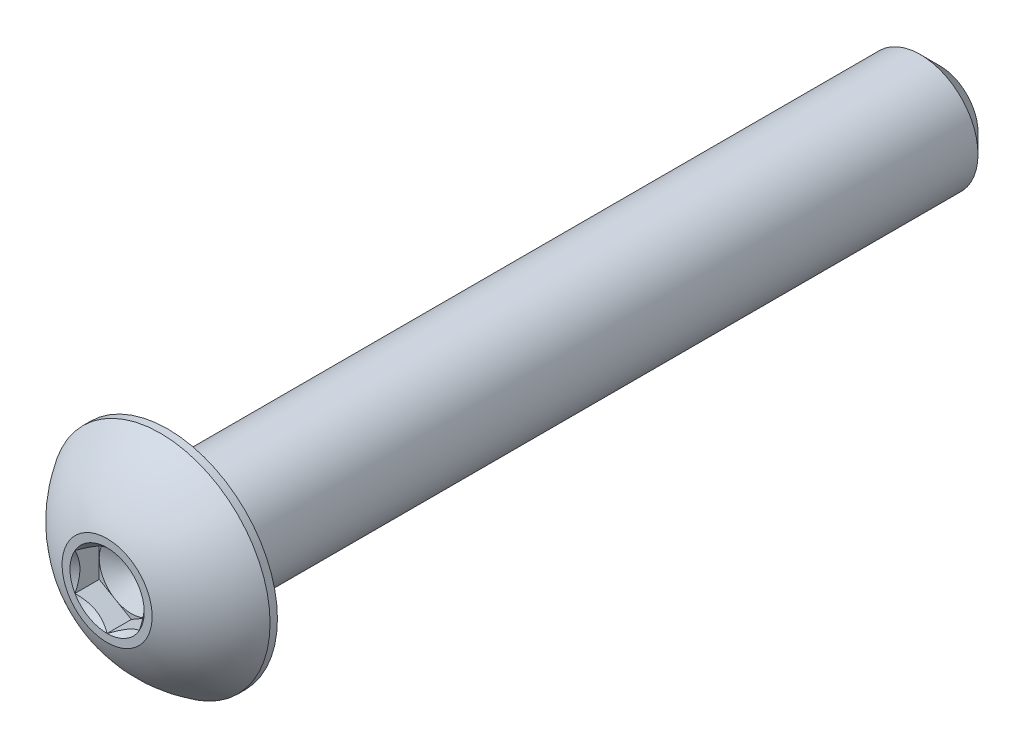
ISO-10303-21;
HEADER;
FILE_DESCRIPTION(('STEP AP214'),'2;1');
FILE_NAME('part.step','',(''),(''),'','','');
FILE_SCHEMA(('AUTOMOTIVE_DESIGN { 1 0 10303 214 1 1 1 1 }'));
ENDSEC;
DATA;
#1=APPLICATION_CONTEXT('core data for automotive mechanical design processes');
#2=APPLICATION_PROTOCOL_DEFINITION('international standard','automotive_design',2000,#1);
#3=PRODUCT_CONTEXT('',#1,'mechanical');
#4=PRODUCT('Part','Part','',(#3));
#5=PRODUCT_RELATED_PRODUCT_CATEGORY('part','',(#4));
#6=PRODUCT_DEFINITION_FORMATION('','',#4);
#7=PRODUCT_DEFINITION_CONTEXT('part definition',#1,'design');
#8=PRODUCT_DEFINITION('design','',#6,#7);
#9=PRODUCT_DEFINITION_SHAPE('','',#8);
#10=(LENGTH_UNIT() NAMED_UNIT(*) SI_UNIT(.MILLI.,.METRE.));
#11=(NAMED_UNIT(*) PLANE_ANGLE_UNIT() SI_UNIT($,.RADIAN.));
#12=(NAMED_UNIT(*) SI_UNIT($,.STERADIAN.) SOLID_ANGLE_UNIT());
#13=UNCERTAINTY_MEASURE_WITH_UNIT(LENGTH_MEASURE(1.E-05),#10,'distance_accuracy_value','');
#14=(GEOMETRIC_REPRESENTATION_CONTEXT(3) GLOBAL_UNCERTAINTY_ASSIGNED_CONTEXT((#13)) GLOBAL_UNIT_ASSIGNED_CONTEXT((#10,
#11,#12)) REPRESENTATION_CONTEXT('',''));
#15=CARTESIAN_POINT('',(0.,0.,0.));
#16=DIRECTION('',(0.,0.,1.));
#17=DIRECTION('',(1.,0.,0.));
#18=AXIS2_PLACEMENT_3D('',#15,#16,#17);
#19=CARTESIAN_POINT('',(0.,0.79375,10.2743));
#20=DIRECTION('',(0.,0.,-1.));
#21=DIRECTION('',(-1.,0.,0.));
#22=AXIS2_PLACEMENT_3D('',#19,#20,#21);
#23=PLANE('',#22);
#24=CARTESIAN_POINT('',(0.,0.,10.2743));
#25=DIRECTION('',(0.,0.,1.));
#26=DIRECTION('',(1.,0.,0.));
#27=AXIS2_PLACEMENT_3D('',#24,#25,#26);
#28=CIRCLE('',#27,1.11125);
#29=CARTESIAN_POINT('',(0.,1.11125,10.2743));
#30=VERTEX_POINT('',#29);
#31=EDGE_CURVE('E167',#30,#30,#28,.T.);
#32=ORIENTED_EDGE('',*,*,#31,.T.);
#33=EDGE_LOOP('',(#32));
#34=FACE_BOUND('',#33,.T.);
#35=CARTESIAN_POINT('',(0.,0.,10.2743));
#36=DIRECTION('',(0.,0.,1.));
#37=DIRECTION('',(1.,0.,0.));
#38=AXIS2_PLACEMENT_3D('',#35,#36,#37);
#39=CIRCLE('',#38,0.916543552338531);
#40=CARTESIAN_POINT('',(0.,0.916543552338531,10.2743));
#41=VERTEX_POINT('',#40);
#42=CARTESIAN_POINT('',(-0.79375,0.458271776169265,10.2743));
#43=VERTEX_POINT('',#42);
#44=EDGE_CURVE('E121',#41,#43,#39,.T.);
#45=ORIENTED_EDGE('',*,*,#44,.F.);
#46=CARTESIAN_POINT('',(0.,0.,10.2743));
#47=DIRECTION('',(0.,0.,1.));
#48=DIRECTION('',(1.,0.,0.));
#49=AXIS2_PLACEMENT_3D('',#46,#47,#48);
#50=CIRCLE('',#49,0.916543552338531);
#51=CARTESIAN_POINT('',(0.79375,0.458271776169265,10.2743));
#52=VERTEX_POINT('',#51);
#53=EDGE_CURVE('E106',#52,#41,#50,.T.);
#54=ORIENTED_EDGE('',*,*,#53,.F.);
#55=CARTESIAN_POINT('',(0.,0.,10.2743));
#56=DIRECTION('',(0.,0.,1.));
#57=DIRECTION('',(1.,0.,0.));
#58=AXIS2_PLACEMENT_3D('',#55,#56,#57);
#59=CIRCLE('',#58,0.916543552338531);
#60=CARTESIAN_POINT('',(0.79375,-0.458271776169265,10.2743));
#61=VERTEX_POINT('',#60);
#62=EDGE_CURVE('E117',#61,#52,#59,.T.);
#63=ORIENTED_EDGE('',*,*,#62,.F.);
#64=CARTESIAN_POINT('',(0.,0.,10.2743));
#65=DIRECTION('',(0.,0.,1.));
#66=DIRECTION('',(1.,0.,0.));
#67=AXIS2_PLACEMENT_3D('',#64,#65,#66);
#68=CIRCLE('',#67,0.916543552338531);
#69=CARTESIAN_POINT('',(0.,-0.916543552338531,10.2743));
#70=VERTEX_POINT('',#69);
#71=EDGE_CURVE('E138',#70,#61,#68,.T.);
#72=ORIENTED_EDGE('',*,*,#71,.F.);
#73=CARTESIAN_POINT('',(0.,0.,10.2743));
#74=DIRECTION('',(0.,0.,1.));
#75=DIRECTION('',(1.,0.,0.));
#76=AXIS2_PLACEMENT_3D('',#73,#74,#75);
#77=CIRCLE('',#76,0.916543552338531);
#78=CARTESIAN_POINT('',(-0.79375,-0.458271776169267,10.2743));
#79=VERTEX_POINT('',#78);
#80=EDGE_CURVE('E438',#79,#70,#77,.T.);
#81=ORIENTED_EDGE('',*,*,#80,.F.);
#82=CARTESIAN_POINT('',(0.,0.,10.2743));
#83=DIRECTION('',(0.,0.,1.));
#84=DIRECTION('',(1.,0.,0.));
#85=AXIS2_PLACEMENT_3D('',#82,#83,#84);
#86=CIRCLE('',#85,0.916543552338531);
#87=EDGE_CURVE('E447',#43,#79,#86,.T.);
#88=ORIENTED_EDGE('',*,*,#87,.F.);
#89=EDGE_LOOP('',(#45,#54,#63,#72,#81,#88));
#90=FACE_BOUND('',#89,.T.);
#91=ADVANCED_FACE('F33',(#34,#90),#23,.F.);
#92=CARTESIAN_POINT('',(0.,0.,-10.2743));
#93=DIRECTION('',(0.,0.,1.));
#94=DIRECTION('',(1.,0.,0.));
#95=AXIS2_PLACEMENT_3D('',#92,#93,#94);
#96=CONICAL_SURFACE('',#95,0.946150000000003,0.785398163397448);
#97=CARTESIAN_POINT('',(0.,0.,-9.79805));
#98=DIRECTION('',(0.,0.,1.));
#99=DIRECTION('',(1.,0.,0.));
#100=AXIS2_PLACEMENT_3D('',#97,#98,#99);
#101=CIRCLE('',#100,1.4224);
#102=CARTESIAN_POINT('',(1.4224,0.,-9.79805));
#103=VERTEX_POINT('',#102);
#104=EDGE_CURVE('E11',#103,#103,#101,.T.);
#105=ORIENTED_EDGE('',*,*,#104,.F.);
#106=EDGE_LOOP('',(#105));
#107=FACE_BOUND('',#106,.T.);
#108=CARTESIAN_POINT('',(0.,0.,-10.2743));
#109=DIRECTION('',(0.,0.,1.));
#110=DIRECTION('',(1.,0.,0.));
#111=AXIS2_PLACEMENT_3D('',#108,#109,#110);
#112=CIRCLE('',#111,0.946150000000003);
#113=CARTESIAN_POINT('',(0.946150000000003,0.,-10.2743));
#114=VERTEX_POINT('',#113);
#115=EDGE_CURVE('E160',#114,#114,#112,.T.);
#116=ORIENTED_EDGE('',*,*,#115,.T.);
#117=EDGE_LOOP('',(#116));
#118=FACE_BOUND('',#117,.T.);
#119=ADVANCED_FACE('F35',(#107,#118),#96,.T.);
#120=CARTESIAN_POINT('',(0.,0.,10.2743));
#121=DIRECTION('',(0.,0.,1.));
#122=DIRECTION('',(1.,0.,0.));
#123=AXIS2_PLACEMENT_3D('',#120,#121,#122);
#124=CYLINDRICAL_SURFACE('',#123,1.4224);
#125=CARTESIAN_POINT('',(0.,0.,8.7757));
#126=DIRECTION('',(0.,0.,1.));
#127=DIRECTION('',(1.,0.,0.));
#128=AXIS2_PLACEMENT_3D('',#125,#126,#127);
#129=CIRCLE('',#128,1.4224);
#130=CARTESIAN_POINT('',(1.4224,0.,8.7757));
#131=VERTEX_POINT('',#130);
#132=EDGE_CURVE('E41',#131,#131,#129,.T.);
#133=ORIENTED_EDGE('',*,*,#132,.F.);
#134=EDGE_LOOP('',(#133));
#135=FACE_BOUND('',#134,.T.);
#136=ORIENTED_EDGE('',*,*,#104,.T.);
#137=EDGE_LOOP('',(#136));
#138=FACE_BOUND('',#137,.T.);
#139=ADVANCED_FACE('F181',(#135,#138),#124,.T.);
#140=CARTESIAN_POINT('',(0.,2.7051,8.7757));
#141=DIRECTION('',(0.,0.,1.));
#142=DIRECTION('',(1.,0.,0.));
#143=AXIS2_PLACEMENT_3D('',#140,#141,#142);
#144=PLANE('',#143);
#145=CARTESIAN_POINT('',(0.,0.,8.7757));
#146=DIRECTION('',(0.,0.,1.));
#147=DIRECTION('',(1.,0.,0.));
#148=AXIS2_PLACEMENT_3D('',#145,#146,#147);
#149=CIRCLE('',#148,2.7051);
#150=CARTESIAN_POINT('',(2.7051,0.,8.7757));
#151=VERTEX_POINT('',#150);
#152=EDGE_CURVE('E174',#151,#151,#149,.T.);
#153=ORIENTED_EDGE('',*,*,#152,.F.);
#154=EDGE_LOOP('',(#153));
#155=FACE_BOUND('',#154,.T.);
#156=ORIENTED_EDGE('',*,*,#132,.T.);
#157=EDGE_LOOP('',(#156));
#158=FACE_BOUND('',#157,.T.);
#159=ADVANCED_FACE('F179',(#155,#158),#144,.F.);
#160=CARTESIAN_POINT('',(0.,0.,10.2743));
#161=DIRECTION('',(0.,0.,1.));
#162=DIRECTION('',(1.,0.,0.));
#163=AXIS2_PLACEMENT_3D('',#160,#161,#162);
#164=CYLINDRICAL_SURFACE('',#163,2.7051);
#165=CARTESIAN_POINT('',(0.,0.,8.95712857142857));
#166=DIRECTION('',(0.,0.,1.));
#167=DIRECTION('',(1.,0.,0.));
#168=AXIS2_PLACEMENT_3D('',#165,#166,#167);
#169=CIRCLE('',#168,2.7051);
#170=CARTESIAN_POINT('',(0.,2.7051,8.95712857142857));
#171=VERTEX_POINT('',#170);
#172=EDGE_CURVE('E171',#171,#171,#169,.T.);
#173=ORIENTED_EDGE('',*,*,#172,.F.);
#174=EDGE_LOOP('',(#173));
#175=FACE_BOUND('',#174,.T.);
#176=ORIENTED_EDGE('',*,*,#152,.T.);
#177=EDGE_LOOP('',(#176));
#178=FACE_BOUND('',#177,.T.);
#179=ADVANCED_FACE('F200',(#175,#178),#164,.T.);
#180=CARTESIAN_POINT('',(0.,0.,7.30671740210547));
#181=DIRECTION('',(0.,0.,1.));
#182=DIRECTION('',(0.,1.,0.));
#183=AXIS2_PLACEMENT_3D('',#180,#181,#182);
#184=SPHERICAL_SURFACE('',#183,3.16882044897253);
#185=CARTESIAN_POINT('',(0.,1.11125,10.2743));
#186=CARTESIAN_POINT('',(0.,1.13179667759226,10.2666060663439));
#187=CARTESIAN_POINT('',(0.,1.15226342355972,10.2586986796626));
#188=CARTESIAN_POINT('',(0.,1.19302827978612,10.2424605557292));
#189=CARTESIAN_POINT('',(0.,1.21332639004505,10.2341298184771));
#190=CARTESIAN_POINT('',(0.,1.25374520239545,10.2170485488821));
#191=CARTESIAN_POINT('',(0.,1.27386590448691,10.2082980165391));
#192=CARTESIAN_POINT('',(0.,1.31392122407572,10.1903809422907));
#193=CARTESIAN_POINT('',(0.,1.33385584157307,10.1812144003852));
#194=CARTESIAN_POINT('',(0.,1.37353039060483,10.1624692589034));
#195=CARTESIAN_POINT('',(0.,1.39327032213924,10.1528906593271));
#196=CARTESIAN_POINT('',(0.,1.43254698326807,10.1333255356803));
#197=CARTESIAN_POINT('',(0.,1.45208371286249,10.1233390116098));
#198=CARTESIAN_POINT('',(0.,1.49094554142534,10.102962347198));
#199=CARTESIAN_POINT('',(0.,1.51027064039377,10.0925722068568));
#200=CARTESIAN_POINT('',(0.,1.54870087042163,10.071392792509));
#201=CARTESIAN_POINT('',(0.,1.56780600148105,10.0606035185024));
#202=CARTESIAN_POINT('',(0.,1.60578805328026,10.0386304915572));
#203=CARTESIAN_POINT('',(0.,1.62466497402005,10.0274467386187));
#204=CARTESIAN_POINT('',(0.,1.66218246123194,10.0046895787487));
#205=CARTESIAN_POINT('',(0.,1.68082302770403,9.99311617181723));
#206=CARTESIAN_POINT('',(0.,1.71785976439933,9.96958469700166));
#207=CARTESIAN_POINT('',(0.,1.73625593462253,9.95762662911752));
#208=CARTESIAN_POINT('',(0.,1.77279594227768,9.9333309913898));
#209=CARTESIAN_POINT('',(0.,1.79093977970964,9.92099342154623));
#210=CARTESIAN_POINT('',(0.,1.82696729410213,9.8959441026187));
#211=CARTESIAN_POINT('',(0.,1.84485097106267,9.88323235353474));
#212=CARTESIAN_POINT('',(0.,1.88035044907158,9.85744016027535));
#213=CARTESIAN_POINT('',(0.,1.89796625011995,9.84435971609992));
#214=CARTESIAN_POINT('',(0.,1.93292237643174,9.81783577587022));
#215=CARTESIAN_POINT('',(0.,1.95026270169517,9.80439227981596));
#216=CARTESIAN_POINT('',(0.,1.98466039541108,9.77714803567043));
#217=CARTESIAN_POINT('',(0.,2.00171776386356,9.76334728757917));
#218=CARTESIAN_POINT('',(0.,2.03554218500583,9.73539449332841));
#219=CARTESIAN_POINT('',(0.,2.05230923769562,9.72124244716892));
#220=CARTESIAN_POINT('',(0.,2.08554579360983,9.6925931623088));
#221=CARTESIAN_POINT('',(0.,2.10201529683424,9.67809592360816));
#222=CARTESIAN_POINT('',(0.,2.13464964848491,9.64876250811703));
#223=CARTESIAN_POINT('',(0.,2.15081449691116,9.63392633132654));
#224=CARTESIAN_POINT('',(0.,2.18283256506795,9.60392144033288));
#225=CARTESIAN_POINT('',(0.,2.19868578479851,9.58875272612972));
#226=CARTESIAN_POINT('',(0.,2.23007375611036,9.5580893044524));
#227=CARTESIAN_POINT('',(0.,2.24560850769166,9.54259459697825));
#228=CARTESIAN_POINT('',(0.,2.27635284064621,9.51128587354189));
#229=CARTESIAN_POINT('',(0.,2.29156242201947,9.49547185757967));
#230=CARTESIAN_POINT('',(0.,2.32164985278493,9.46353133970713));
#231=CARTESIAN_POINT('',(0.,2.33652770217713,9.4474048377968));
#232=CARTESIAN_POINT('',(0.,2.3659452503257,9.41484630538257));
#233=CARTESIAN_POINT('',(0.,2.38048494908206,9.39841427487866));
#234=CARTESIAN_POINT('',(0.,2.40921992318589,9.36525177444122));
#235=CARTESIAN_POINT('',(0.,2.42341519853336,9.3485213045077));
#236=CARTESIAN_POINT('',(0.,2.45145520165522,9.31476914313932));
#237=CARTESIAN_POINT('',(0.,2.4652999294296,9.29774745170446));
#238=CARTESIAN_POINT('',(0.,2.49263286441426,9.26342019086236));
#239=CARTESIAN_POINT('',(0.,2.50612107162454,9.24611462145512));
#240=CARTESIAN_POINT('',(0.,2.53273514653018,9.21122707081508));
#241=CARTESIAN_POINT('',(0.,2.54586101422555,9.19364508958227));
#242=CARTESIAN_POINT('',(0.,2.57174474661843,9.15821230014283));
#243=CARTESIAN_POINT('',(0.,2.58450261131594,9.1403614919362));
#244=CARTESIAN_POINT('',(0.,2.60964483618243,9.10439875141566));
#245=CARTESIAN_POINT('',(0.,2.62202919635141,9.08628681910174));
#246=CARTESIAN_POINT('',(0.,2.64641905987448,9.04980963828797));
#247=CARTESIAN_POINT('',(0.,2.65842456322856,9.03144438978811));
#248=CARTESIAN_POINT('',(0.,2.68205156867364,8.99446852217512));
#249=CARTESIAN_POINT('',(0.,2.69367307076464,8.97585790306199));
#250=CARTESIAN_POINT('',(0.,2.7051,8.95712857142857));
#251=B_SPLINE_CURVE_WITH_KNOTS('',3,(#185,#186,#187,#188,#189,#190,#191,#192,#193,#194,#195,
#196,#197,#198,#199,#200,#201,#202,#203,#204,#205,#206,#207,#208,#209,#210,#211,#212,#213,#214,
#215,#216,#217,#218,#219,#220,#221,#222,#223,#224,#225,#226,#227,#228,#229,#230,#231,#232,#233,
#234,#235,#236,#237,#238,#239,#240,#241,#242,#243,#244,#245,#246,#247,#248,#249,#250),
.UNSPECIFIED.,.F.,.F.,(4,2,2,2,2,2,2,2,2,2,2,2,2,2,2,2,2,2,2,2,2,2,2,2,2,2,2,2,2,2,2,2,4),(0.,
0.0658187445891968,0.131637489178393,0.197456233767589,0.263274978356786,0.329093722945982,
0.394912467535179,0.460731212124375,0.526549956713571,0.592368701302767,0.658187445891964,
0.72400619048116,0.789824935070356,0.855643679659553,0.921462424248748,0.987281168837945,
1.05309991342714,1.11891865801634,1.18473740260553,1.25055614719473,1.31637489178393,
1.38219363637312,1.44801238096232,1.51383112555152,1.57964987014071,1.64546861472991,
1.71128735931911,1.7771061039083,1.8429248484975,1.9087435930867,1.97456233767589,
2.04038108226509,2.10619982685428),.UNSPECIFIED.);
#252=EDGE_CURVE('BSEAM192',#30,#171,#251,.T.);
#253=ORIENTED_EDGE('',*,*,#31,.F.);
#254=ORIENTED_EDGE('',*,*,#172,.T.);
#255=ORIENTED_EDGE('',*,*,#252,.T.);
#256=ORIENTED_EDGE('',*,*,#252,.F.);
#257=EDGE_LOOP('',(#253,#255,#254,#256));
#258=FACE_BOUND('',#257,.T.);
#259=ADVANCED_FACE('F192',(#258),#184,.T.);
#260=CARTESIAN_POINT('',(0.,0.946150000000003,-10.2743));
#261=DIRECTION('',(0.,0.,1.));
#262=DIRECTION('',(1.,0.,0.));
#263=AXIS2_PLACEMENT_3D('',#260,#261,#262);
#264=PLANE('',#263);
#265=ORIENTED_EDGE('',*,*,#115,.F.);
#266=EDGE_LOOP('',(#265));
#267=FACE_BOUND('',#266,.T.);
#268=ADVANCED_FACE('F190',(#267),#264,.F.);
#269=CARTESIAN_POINT('',(0.79375,0.458271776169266,10.2743));
#270=DIRECTION('',(-0.499999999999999,-0.866025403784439,0.));
#271=DIRECTION('',(0.866025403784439,-0.499999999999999,0.));
#272=AXIS2_PLACEMENT_3D('',#269,#270,#271);
#273=PLANE('',#272);
#274=CARTESIAN_POINT('',(0.79395,0.458156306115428,10.2744154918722));
#275=CARTESIAN_POINT('',(0.7666563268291,0.473914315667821,10.25866677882));
#276=CARTESIAN_POINT('',(0.738906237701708,0.489935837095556,10.2438425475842));
#277=CARTESIAN_POINT('',(0.68232025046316,0.522605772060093,10.2166990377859));
#278=CARTESIAN_POINT('',(0.653478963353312,0.539257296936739,10.2043948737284));
#279=CARTESIAN_POINT('',(0.595321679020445,0.572834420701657,10.1833173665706));
#280=CARTESIAN_POINT('',(0.56602051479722,0.589751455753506,10.1744910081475));
#281=CARTESIAN_POINT('',(0.506773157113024,0.62395793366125,10.1608912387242));
#282=CARTESIAN_POINT('',(0.476828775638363,0.641246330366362,10.15610766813));
#283=CARTESIAN_POINT('',(0.425225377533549,0.671039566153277,10.1517934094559));
#284=CARTESIAN_POINT('',(0.403633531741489,0.683505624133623,10.151155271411));
#285=CARTESIAN_POINT('',(0.360491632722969,0.708413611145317,10.1522261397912));
#286=CARTESIAN_POINT('',(0.338941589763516,0.720855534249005,10.1539356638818));
#287=CARTESIAN_POINT('',(0.274599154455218,0.758003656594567,10.1624727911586));
#288=CARTESIAN_POINT('',(0.232126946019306,0.782524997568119,10.1727099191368));
#289=CARTESIAN_POINT('',(0.157575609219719,0.825567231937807,10.1974185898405));
#290=CARTESIAN_POINT('',(0.125147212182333,0.844289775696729,10.2105961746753));
#291=CARTESIAN_POINT('',(0.0615608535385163,0.881001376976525,10.2402810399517));
#292=CARTESIAN_POINT('',(0.0303991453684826,0.898992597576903,10.2567774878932));
#293=CARTESIAN_POINT('',(-0.000200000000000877,0.916659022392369,10.2744154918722));
#294=B_SPLINE_CURVE_WITH_KNOTS('',3,(#274,#275,#276,#277,#278,#279,#280,#281,#282,#283,#284,
#285,#286,#287,#288,#289,#290,#291,#292,#293),.UNSPECIFIED.,.F.,.F.,(4,2,2,2,2,2,2,2,2,4),(0.,
0.105768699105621,0.21215429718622,0.316848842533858,0.421279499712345,0.495991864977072,
0.570720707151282,0.720221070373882,0.8391503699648,0.957697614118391),.UNSPECIFIED.);
#295=EDGE_CURVE('E103',#52,#41,#294,.T.);
#296=ORIENTED_EDGE('',*,*,#295,.T.);
#297=DIRECTION('',(0.,0.,-1.));
#298=VECTOR('',#297,1.);
#299=CARTESIAN_POINT('',(0.,0.916543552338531,10.2743));
#300=LINE('',#299,#298);
#301=CARTESIAN_POINT('',(0.,0.916543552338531,9.67486));
#302=VERTEX_POINT('',#301);
#303=EDGE_CURVE('E158',#41,#302,#300,.T.);
#304=ORIENTED_EDGE('',*,*,#303,.T.);
#305=DIRECTION('',(-0.866025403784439,0.499999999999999,0.));
#306=VECTOR('',#305,1.);
#307=CARTESIAN_POINT('',(0.79375,0.458271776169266,9.67486));
#308=LINE('',#307,#306);
#309=CARTESIAN_POINT('',(0.396874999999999,0.687407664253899,9.67486));
#310=VERTEX_POINT('',#309);
#311=EDGE_CURVE('E474',#310,#302,#308,.T.);
#312=ORIENTED_EDGE('',*,*,#311,.F.);
#313=CARTESIAN_POINT('',(0.79375,0.458271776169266,9.67486));
#314=VERTEX_POINT('',#313);
#315=EDGE_CURVE('E48',#314,#310,#308,.T.);
#316=ORIENTED_EDGE('',*,*,#315,.F.);
#317=DIRECTION('',(0.,0.,-1.));
#318=VECTOR('',#317,1.);
#319=CARTESIAN_POINT('',(0.79375,0.458271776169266,10.2743));
#320=LINE('',#319,#318);
#321=EDGE_CURVE('E134',#52,#314,#320,.T.);
#322=ORIENTED_EDGE('',*,*,#321,.F.);
#323=EDGE_LOOP('',(#296,#304,#312,#316,#322));
#324=FACE_BOUND('',#323,.T.);
#325=ADVANCED_FACE('F140',(#324),#273,.T.);
#326=CARTESIAN_POINT('',(0.,0.916543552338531,10.2743));
#327=DIRECTION('',(0.5,-0.866025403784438,0.));
#328=DIRECTION('',(0.866025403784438,0.500000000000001,0.));
#329=AXIS2_PLACEMENT_3D('',#326,#327,#328);
#330=PLANE('',#329);
#331=CARTESIAN_POINT('',(0.000199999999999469,0.916659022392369,10.2744154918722));
#332=CARTESIAN_POINT('',(-0.0270936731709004,0.900901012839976,10.25866677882));
#333=CARTESIAN_POINT('',(-0.0548437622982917,0.884879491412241,10.2438425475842));
#334=CARTESIAN_POINT('',(-0.111429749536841,0.852209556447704,10.2166990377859));
#335=CARTESIAN_POINT('',(-0.140271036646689,0.835558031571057,10.2043948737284));
#336=CARTESIAN_POINT('',(-0.198428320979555,0.801980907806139,10.1833173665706));
#337=CARTESIAN_POINT('',(-0.22772948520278,0.785063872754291,10.1744910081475));
#338=CARTESIAN_POINT('',(-0.286976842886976,0.750857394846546,10.1608912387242));
#339=CARTESIAN_POINT('',(-0.316921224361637,0.733568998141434,10.15610766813));
#340=CARTESIAN_POINT('',(-0.368524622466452,0.70377576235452,10.1517934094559));
#341=CARTESIAN_POINT('',(-0.390116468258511,0.691309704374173,10.151155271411));
#342=CARTESIAN_POINT('',(-0.433258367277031,0.666401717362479,10.1522261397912));
#343=CARTESIAN_POINT('',(-0.454808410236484,0.653959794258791,10.1539356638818));
#344=CARTESIAN_POINT('',(-0.519150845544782,0.616811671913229,10.1624727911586));
#345=CARTESIAN_POINT('',(-0.561623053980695,0.592290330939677,10.1727099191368));
#346=CARTESIAN_POINT('',(-0.636174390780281,0.549248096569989,10.1974185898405));
#347=CARTESIAN_POINT('',(-0.668602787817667,0.530525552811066,10.2105961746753));
#348=CARTESIAN_POINT('',(-0.732189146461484,0.493813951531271,10.2402810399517));
#349=CARTESIAN_POINT('',(-0.763350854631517,0.475822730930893,10.2567774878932));
#350=CARTESIAN_POINT('',(-0.79395,0.458156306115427,10.2744154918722));
#351=B_SPLINE_CURVE_WITH_KNOTS('',3,(#331,#332,#333,#334,#335,#336,#337,#338,#339,#340,#341,
#342,#343,#344,#345,#346,#347,#348,#349,#350),.UNSPECIFIED.,.F.,.F.,(4,2,2,2,2,2,2,2,2,4),(0.,
0.105768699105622,0.21215429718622,0.316848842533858,0.421279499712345,0.495991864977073,
0.570720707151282,0.720221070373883,0.839150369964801,0.957697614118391),.UNSPECIFIED.);
#352=EDGE_CURVE('E462',#41,#43,#351,.T.);
#353=ORIENTED_EDGE('',*,*,#352,.T.);
#354=DIRECTION('',(0.,0.,-1.));
#355=VECTOR('',#354,1.);
#356=CARTESIAN_POINT('',(-0.79375,0.458271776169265,10.2743));
#357=LINE('',#356,#355);
#358=CARTESIAN_POINT('',(-0.79375,0.458271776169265,9.67486));
#359=VERTEX_POINT('',#358);
#360=EDGE_CURVE('E155',#43,#359,#357,.T.);
#361=ORIENTED_EDGE('',*,*,#360,.T.);
#362=DIRECTION('',(-0.866025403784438,-0.500000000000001,0.));
#363=VECTOR('',#362,1.);
#364=CARTESIAN_POINT('',(0.,0.916543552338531,9.67486));
#365=LINE('',#364,#363);
#366=CARTESIAN_POINT('',(-0.396875,0.687407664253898,9.67486));
#367=VERTEX_POINT('',#366);
#368=EDGE_CURVE('E476',#367,#359,#365,.T.);
#369=ORIENTED_EDGE('',*,*,#368,.F.);
#370=EDGE_CURVE('E477',#302,#367,#365,.T.);
#371=ORIENTED_EDGE('',*,*,#370,.F.);
#372=ORIENTED_EDGE('',*,*,#303,.F.);
#373=EDGE_LOOP('',(#353,#361,#369,#371,#372));
#374=FACE_BOUND('',#373,.T.);
#375=ADVANCED_FACE('F198',(#374),#330,.T.);
#376=CARTESIAN_POINT('',(-0.79375,0.458271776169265,10.2743));
#377=DIRECTION('',(1.,0.,0.));
#378=DIRECTION('',(0.,1.,0.));
#379=AXIS2_PLACEMENT_3D('',#376,#377,#378);
#380=PLANE('',#379);
#381=CARTESIAN_POINT('',(-0.79375,-0.886414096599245,10.5476173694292));
#382=CARTESIAN_POINT('',(-0.79375,-0.86470171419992,10.5314447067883));
#383=CARTESIAN_POINT('',(-0.79375,-0.842865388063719,10.5154388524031));
#384=CARTESIAN_POINT('',(-0.79375,-0.798895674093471,10.4838287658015));
#385=CARTESIAN_POINT('',(-0.79375,-0.776762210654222,10.468224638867));
#386=CARTESIAN_POINT('',(-0.79375,-0.709518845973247,10.421894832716));
#387=CARTESIAN_POINT('',(-0.79375,-0.663896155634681,10.3919009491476));
#388=CARTESIAN_POINT('',(-0.79375,-0.568400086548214,10.3332651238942));
#389=CARTESIAN_POINT('',(-0.79375,-0.518429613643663,10.3047793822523));
#390=CARTESIAN_POINT('',(-0.79375,-0.416032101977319,10.2528450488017));
#391=CARTESIAN_POINT('',(-0.79375,-0.363614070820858,10.2293795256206));
#392=CARTESIAN_POINT('',(-0.79375,-0.284656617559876,10.200683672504));
#393=CARTESIAN_POINT('',(-0.79375,-0.259232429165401,10.192404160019));
#394=CARTESIAN_POINT('',(-0.79375,-0.20780736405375,10.1778843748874));
#395=CARTESIAN_POINT('',(-0.79375,-0.18180644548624,10.171644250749));
#396=CARTESIAN_POINT('',(-0.79375,-0.104000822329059,10.1567094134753));
#397=CARTESIAN_POINT('',(-0.79375,-0.0514629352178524,10.1514391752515));
#398=CARTESIAN_POINT('',(-0.79375,0.051923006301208,10.151572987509));
#399=CARTESIAN_POINT('',(-0.79375,0.102771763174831,10.1566435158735));
#400=CARTESIAN_POINT('',(-0.79375,0.178135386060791,10.1708587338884));
#401=CARTESIAN_POINT('',(-0.79375,0.203324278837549,10.1767816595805));
#402=CARTESIAN_POINT('',(-0.79375,0.253165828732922,10.1905603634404));
#403=CARTESIAN_POINT('',(-0.79375,0.277818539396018,10.1984159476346));
#404=CARTESIAN_POINT('',(-0.79375,0.356745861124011,10.2264886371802));
#405=CARTESIAN_POINT('',(-0.79375,0.409857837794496,10.2499580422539));
#406=CARTESIAN_POINT('',(-0.79375,0.513576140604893,10.3020968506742));
#407=CARTESIAN_POINT('',(-0.79375,0.564172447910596,10.3307852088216));
#408=CARTESIAN_POINT('',(-0.79375,0.660846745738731,10.3899268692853));
#409=CARTESIAN_POINT('',(-0.79375,0.707024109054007,10.4202197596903));
#410=CARTESIAN_POINT('',(-0.79375,0.775058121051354,10.4670303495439));
#411=CARTESIAN_POINT('',(-0.79375,0.797441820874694,10.482795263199));
#412=CARTESIAN_POINT('',(-0.79375,0.841904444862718,10.5147370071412));
#413=CARTESIAN_POINT('',(-0.79375,0.863983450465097,10.5309137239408));
#414=CARTESIAN_POINT('',(-0.79375,0.885935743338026,10.5472610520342));
#415=B_SPLINE_CURVE_WITH_KNOTS('',3,(#381,#382,#383,#384,#385,#386,#387,#388,#389,#390,#391,
#392,#393,#394,#395,#396,#397,#398,#399,#400,#401,#402,#403,#404,#405,#406,#407,#408,#409,#410,
#411,#412,#413,#414),.UNSPECIFIED.,.F.,.F.,(4,2,2,2,2,2,2,2,2,2,2,2,2,2,2,2,4),(0.,
0.0812188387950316,0.162458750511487,0.326178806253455,0.498586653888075,0.670403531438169,
0.750543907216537,0.830690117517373,0.988028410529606,1.14037233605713,1.21793318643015,
1.29548625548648,1.46917505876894,1.64350775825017,1.80910713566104,1.8912384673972,
1.97334740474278),.UNSPECIFIED.);
#416=EDGE_CURVE('E455',#43,#79,#415,.F.);
#417=ORIENTED_EDGE('',*,*,#416,.T.);
#418=DIRECTION('',(0.,0.,-1.));
#419=VECTOR('',#418,1.);
#420=CARTESIAN_POINT('',(-0.79375,-0.458271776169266,10.2743));
#421=LINE('',#420,#419);
#422=CARTESIAN_POINT('',(-0.79375,-0.458271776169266,9.67486));
#423=VERTEX_POINT('',#422);
#424=EDGE_CURVE('E152',#79,#423,#421,.T.);
#425=ORIENTED_EDGE('',*,*,#424,.T.);
#426=DIRECTION('',(0.,-1.,0.));
#427=VECTOR('',#426,1.);
#428=CARTESIAN_POINT('',(-0.79375,0.458271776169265,9.67486));
#429=LINE('',#428,#427);
#430=CARTESIAN_POINT('',(-0.79375,0.,9.67486));
#431=VERTEX_POINT('',#430);
#432=EDGE_CURVE('E480',#431,#423,#429,.T.);
#433=ORIENTED_EDGE('',*,*,#432,.F.);
#434=EDGE_CURVE('E481',#359,#431,#429,.T.);
#435=ORIENTED_EDGE('',*,*,#434,.F.);
#436=ORIENTED_EDGE('',*,*,#360,.F.);
#437=EDGE_LOOP('',(#417,#425,#433,#435,#436));
#438=FACE_BOUND('',#437,.T.);
#439=ADVANCED_FACE('F319',(#438),#380,.T.);
#440=CARTESIAN_POINT('',(-0.79375,-0.458271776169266,10.2743));
#441=DIRECTION('',(0.5,0.866025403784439,0.));
#442=DIRECTION('',(-0.866025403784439,0.5,0.));
#443=AXIS2_PLACEMENT_3D('',#440,#441,#442);
#444=PLANE('',#443);
#445=CARTESIAN_POINT('',(-0.79395,-0.458156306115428,10.2744154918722));
#446=CARTESIAN_POINT('',(-0.7666563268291,-0.473914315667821,10.25866677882));
#447=CARTESIAN_POINT('',(-0.738906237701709,-0.489935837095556,10.2438425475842));
#448=CARTESIAN_POINT('',(-0.68232025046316,-0.522605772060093,10.2166990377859));
#449=CARTESIAN_POINT('',(-0.653478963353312,-0.539257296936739,10.2043948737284));
#450=CARTESIAN_POINT('',(-0.595321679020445,-0.572834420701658,10.1833173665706));
#451=CARTESIAN_POINT('',(-0.56602051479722,-0.589751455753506,10.1744910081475));
#452=CARTESIAN_POINT('',(-0.506773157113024,-0.623957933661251,10.1608912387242));
#453=CARTESIAN_POINT('',(-0.476828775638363,-0.641246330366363,10.15610766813));
#454=CARTESIAN_POINT('',(-0.425225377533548,-0.671039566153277,10.1517934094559));
#455=CARTESIAN_POINT('',(-0.403633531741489,-0.683505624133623,10.151155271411));
#456=CARTESIAN_POINT('',(-0.360491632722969,-0.708413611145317,10.1522261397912));
#457=CARTESIAN_POINT('',(-0.338941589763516,-0.720855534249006,10.1539356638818));
#458=CARTESIAN_POINT('',(-0.274599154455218,-0.758003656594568,10.1624727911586));
#459=CARTESIAN_POINT('',(-0.232126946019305,-0.782524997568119,10.1727099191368));
#460=CARTESIAN_POINT('',(-0.157575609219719,-0.825567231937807,10.1974185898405));
#461=CARTESIAN_POINT('',(-0.125147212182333,-0.84428977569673,10.2105961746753));
#462=CARTESIAN_POINT('',(-0.0615608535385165,-0.881001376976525,10.2402810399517));
#463=CARTESIAN_POINT('',(-0.0303991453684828,-0.898992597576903,10.2567774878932));
#464=CARTESIAN_POINT('',(0.000200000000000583,-0.916659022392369,10.2744154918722));
#465=B_SPLINE_CURVE_WITH_KNOTS('',3,(#445,#446,#447,#448,#449,#450,#451,#452,#453,#454,#455,
#456,#457,#458,#459,#460,#461,#462,#463,#464),.UNSPECIFIED.,.F.,.F.,(4,2,2,2,2,2,2,2,2,4),(0.,
0.105768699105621,0.21215429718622,0.316848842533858,0.421279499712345,0.495991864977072,
0.570720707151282,0.720221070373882,0.8391503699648,0.957697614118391),.UNSPECIFIED.);
#466=EDGE_CURVE('E440',#79,#70,#465,.T.);
#467=ORIENTED_EDGE('',*,*,#466,.T.);
#468=DIRECTION('',(0.,0.,-1.));
#469=VECTOR('',#468,1.);
#470=CARTESIAN_POINT('',(0.,-0.916543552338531,10.2743));
#471=LINE('',#470,#469);
#472=CARTESIAN_POINT('',(0.,-0.916543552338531,9.67486));
#473=VERTEX_POINT('',#472);
#474=EDGE_CURVE('E143',#70,#473,#471,.T.);
#475=ORIENTED_EDGE('',*,*,#474,.T.);
#476=DIRECTION('',(0.866025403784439,-0.5,0.));
#477=VECTOR('',#476,1.);
#478=CARTESIAN_POINT('',(-0.79375,-0.458271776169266,9.67486));
#479=LINE('',#478,#477);
#480=CARTESIAN_POINT('',(-0.396875,-0.687407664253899,9.67486));
#481=VERTEX_POINT('',#480);
#482=EDGE_CURVE('E484',#481,#473,#479,.T.);
#483=ORIENTED_EDGE('',*,*,#482,.F.);
#484=EDGE_CURVE('E485',#423,#481,#479,.T.);
#485=ORIENTED_EDGE('',*,*,#484,.F.);
#486=ORIENTED_EDGE('',*,*,#424,.F.);
#487=EDGE_LOOP('',(#467,#475,#483,#485,#486));
#488=FACE_BOUND('',#487,.T.);
#489=ADVANCED_FACE('F329',(#488),#444,.T.);
#490=CARTESIAN_POINT('',(0.,-0.916543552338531,10.2743));
#491=DIRECTION('',(-0.5,0.866025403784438,0.));
#492=DIRECTION('',(-0.866025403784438,-0.5,0.));
#493=AXIS2_PLACEMENT_3D('',#490,#491,#492);
#494=PLANE('',#493);
#495=CARTESIAN_POINT('',(-0.000199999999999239,-0.916659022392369,10.2744154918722));
#496=CARTESIAN_POINT('',(0.0270936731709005,-0.900901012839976,10.25866677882));
#497=CARTESIAN_POINT('',(0.054843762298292,-0.884879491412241,10.2438425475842));
#498=CARTESIAN_POINT('',(0.111429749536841,-0.852209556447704,10.2166990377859));
#499=CARTESIAN_POINT('',(0.140271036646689,-0.835558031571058,10.2043948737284));
#500=CARTESIAN_POINT('',(0.198428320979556,-0.801980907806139,10.1833173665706));
#501=CARTESIAN_POINT('',(0.227729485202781,-0.785063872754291,10.1744910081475));
#502=CARTESIAN_POINT('',(0.286976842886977,-0.750857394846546,10.1608912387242));
#503=CARTESIAN_POINT('',(0.316921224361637,-0.733568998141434,10.15610766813));
#504=CARTESIAN_POINT('',(0.368524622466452,-0.70377576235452,10.1517934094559));
#505=CARTESIAN_POINT('',(0.390116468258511,-0.691309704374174,10.151155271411));
#506=CARTESIAN_POINT('',(0.433258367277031,-0.666401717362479,10.1522261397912));
#507=CARTESIAN_POINT('',(0.454808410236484,-0.653959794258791,10.1539356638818));
#508=CARTESIAN_POINT('',(0.519150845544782,-0.616811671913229,10.1624727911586));
#509=CARTESIAN_POINT('',(0.561623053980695,-0.592290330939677,10.1727099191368));
#510=CARTESIAN_POINT('',(0.636174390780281,-0.54924809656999,10.1974185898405));
#511=CARTESIAN_POINT('',(0.668602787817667,-0.530525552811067,10.2105961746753));
#512=CARTESIAN_POINT('',(0.732189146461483,-0.493813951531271,10.2402810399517));
#513=CARTESIAN_POINT('',(0.763350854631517,-0.475822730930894,10.2567774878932));
#514=CARTESIAN_POINT('',(0.793950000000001,-0.458156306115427,10.2744154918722));
#515=B_SPLINE_CURVE_WITH_KNOTS('',3,(#495,#496,#497,#498,#499,#500,#501,#502,#503,#504,#505,
#506,#507,#508,#509,#510,#511,#512,#513,#514),.UNSPECIFIED.,.F.,.F.,(4,2,2,2,2,2,2,2,2,4),(0.,
0.105768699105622,0.21215429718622,0.316848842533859,0.421279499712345,0.495991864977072,
0.570720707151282,0.720221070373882,0.8391503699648,0.957697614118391),.UNSPECIFIED.);
#516=EDGE_CURVE('E431',#70,#61,#515,.T.);
#517=ORIENTED_EDGE('',*,*,#516,.T.);
#518=DIRECTION('',(0.,0.,-1.));
#519=VECTOR('',#518,1.);
#520=CARTESIAN_POINT('',(0.79375,-0.458271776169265,10.2743));
#521=LINE('',#520,#519);
#522=CARTESIAN_POINT('',(0.79375,-0.458271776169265,9.67486));
#523=VERTEX_POINT('',#522);
#524=EDGE_CURVE('E137',#61,#523,#521,.T.);
#525=ORIENTED_EDGE('',*,*,#524,.T.);
#526=DIRECTION('',(0.866025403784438,0.5,0.));
#527=VECTOR('',#526,1.);
#528=CARTESIAN_POINT('',(0.,-0.916543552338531,9.67486));
#529=LINE('',#528,#527);
#530=CARTESIAN_POINT('',(0.396875,-0.687407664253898,9.67486));
#531=VERTEX_POINT('',#530);
#532=EDGE_CURVE('E487',#531,#523,#529,.T.);
#533=ORIENTED_EDGE('',*,*,#532,.F.);
#534=EDGE_CURVE('E488',#473,#531,#529,.T.);
#535=ORIENTED_EDGE('',*,*,#534,.F.);
#536=ORIENTED_EDGE('',*,*,#474,.F.);
#537=EDGE_LOOP('',(#517,#525,#533,#535,#536));
#538=FACE_BOUND('',#537,.T.);
#539=ADVANCED_FACE('F339',(#538),#494,.T.);
#540=CARTESIAN_POINT('',(0.79375,-0.458271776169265,10.2743));
#541=DIRECTION('',(-1.,0.,0.));
#542=DIRECTION('',(0.,0.,1.));
#543=AXIS2_PLACEMENT_3D('',#540,#541,#542);
#544=PLANE('',#543);
#545=CARTESIAN_POINT('',(0.79375,-0.886414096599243,10.5476173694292));
#546=CARTESIAN_POINT('',(0.79375,-0.864701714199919,10.5314447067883));
#547=CARTESIAN_POINT('',(0.79375,-0.842865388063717,10.5154388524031));
#548=CARTESIAN_POINT('',(0.79375,-0.798895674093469,10.4838287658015));
#549=CARTESIAN_POINT('',(0.79375,-0.77676221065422,10.468224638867));
#550=CARTESIAN_POINT('',(0.79375,-0.709518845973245,10.421894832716));
#551=CARTESIAN_POINT('',(0.79375,-0.663896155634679,10.3919009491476));
#552=CARTESIAN_POINT('',(0.79375,-0.568400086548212,10.3332651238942));
#553=CARTESIAN_POINT('',(0.79375,-0.518429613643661,10.3047793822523));
#554=CARTESIAN_POINT('',(0.79375,-0.416032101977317,10.2528450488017));
#555=CARTESIAN_POINT('',(0.79375,-0.363614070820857,10.2293795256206));
#556=CARTESIAN_POINT('',(0.79375,-0.284656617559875,10.200683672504));
#557=CARTESIAN_POINT('',(0.79375,-0.2592324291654,10.192404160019));
#558=CARTESIAN_POINT('',(0.79375,-0.207807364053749,10.1778843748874));
#559=CARTESIAN_POINT('',(0.79375,-0.18180644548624,10.171644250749));
#560=CARTESIAN_POINT('',(0.79375,-0.104000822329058,10.1567094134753));
#561=CARTESIAN_POINT('',(0.79375,-0.0514629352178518,10.1514391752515));
#562=CARTESIAN_POINT('',(0.79375,0.0519230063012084,10.151572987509));
#563=CARTESIAN_POINT('',(0.79375,0.102771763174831,10.1566435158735));
#564=CARTESIAN_POINT('',(0.79375,0.178135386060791,10.1708587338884));
#565=CARTESIAN_POINT('',(0.79375,0.203324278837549,10.1767816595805));
#566=CARTESIAN_POINT('',(0.79375,0.253165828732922,10.1905603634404));
#567=CARTESIAN_POINT('',(0.79375,0.277818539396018,10.1984159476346));
#568=CARTESIAN_POINT('',(0.79375,0.356745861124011,10.2264886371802));
#569=CARTESIAN_POINT('',(0.79375,0.409857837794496,10.2499580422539));
#570=CARTESIAN_POINT('',(0.79375,0.513576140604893,10.3020968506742));
#571=CARTESIAN_POINT('',(0.79375,0.564172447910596,10.3307852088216));
#572=CARTESIAN_POINT('',(0.79375,0.660846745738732,10.3899268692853));
#573=CARTESIAN_POINT('',(0.79375,0.707024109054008,10.4202197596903));
#574=CARTESIAN_POINT('',(0.79375,0.775058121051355,10.4670303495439));
#575=CARTESIAN_POINT('',(0.79375,0.797441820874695,10.482795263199));
#576=CARTESIAN_POINT('',(0.79375,0.841904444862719,10.5147370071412));
#577=CARTESIAN_POINT('',(0.79375,0.863983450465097,10.5309137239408));
#578=CARTESIAN_POINT('',(0.79375,0.885935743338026,10.5472610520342));
#579=B_SPLINE_CURVE_WITH_KNOTS('',3,(#545,#546,#547,#548,#549,#550,#551,#552,#553,#554,#555,
#556,#557,#558,#559,#560,#561,#562,#563,#564,#565,#566,#567,#568,#569,#570,#571,#572,#573,#574,
#575,#576,#577,#578),.UNSPECIFIED.,.F.,.F.,(4,2,2,2,2,2,2,2,2,2,2,2,2,2,2,2,4),(0.,
0.0812188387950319,0.162458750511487,0.326178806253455,0.498586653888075,0.670403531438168,
0.750543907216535,0.83069011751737,0.988028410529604,1.14037233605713,1.21793318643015,
1.29548625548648,1.46917505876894,1.64350775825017,1.80910713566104,1.8912384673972,
1.97334740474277),.UNSPECIFIED.);
#580=EDGE_CURVE('E127',#61,#52,#579,.T.);
#581=ORIENTED_EDGE('',*,*,#580,.T.);
#582=ORIENTED_EDGE('',*,*,#321,.T.);
#583=DIRECTION('',(0.,1.,0.));
#584=VECTOR('',#583,1.);
#585=CARTESIAN_POINT('',(0.79375,-0.458271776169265,9.67486));
#586=LINE('',#585,#584);
#587=CARTESIAN_POINT('',(0.79375,0.,9.67486));
#588=VERTEX_POINT('',#587);
#589=EDGE_CURVE('E146',#588,#314,#586,.T.);
#590=ORIENTED_EDGE('',*,*,#589,.F.);
#591=EDGE_CURVE('E141',#523,#588,#586,.T.);
#592=ORIENTED_EDGE('',*,*,#591,.F.);
#593=ORIENTED_EDGE('',*,*,#524,.F.);
#594=EDGE_LOOP('',(#581,#582,#590,#592,#593));
#595=FACE_BOUND('',#594,.T.);
#596=ADVANCED_FACE('F132',(#595),#544,.T.);
#597=CARTESIAN_POINT('',(0.,0.,9.67486));
#598=DIRECTION('',(0.,0.,1.));
#599=DIRECTION('',(1.,0.,0.));
#600=AXIS2_PLACEMENT_3D('',#597,#598,#599);
#601=PLANE('',#600);
#602=CARTESIAN_POINT('',(0.,0.,9.67486));
#603=DIRECTION('',(0.,0.,1.));
#604=DIRECTION('',(1.,0.,0.));
#605=AXIS2_PLACEMENT_3D('',#602,#603,#604);
#606=CIRCLE('',#605,0.79375);
#607=EDGE_CURVE('E163',#531,#588,#606,.T.);
#608=ORIENTED_EDGE('',*,*,#607,.F.);
#609=ORIENTED_EDGE('',*,*,#532,.T.);
#610=ORIENTED_EDGE('',*,*,#591,.T.);
#611=EDGE_LOOP('',(#608,#609,#610));
#612=FACE_BOUND('',#611,.T.);
#613=ADVANCED_FACE('F241',(#612),#601,.T.);
#614=EDGE_CURVE('E500',#481,#531,#606,.T.);
#615=ORIENTED_EDGE('',*,*,#614,.F.);
#616=ORIENTED_EDGE('',*,*,#482,.T.);
#617=ORIENTED_EDGE('',*,*,#534,.T.);
#618=EDGE_LOOP('',(#615,#616,#617));
#619=FACE_BOUND('',#618,.T.);
#620=ADVANCED_FACE('F246',(#619),#601,.T.);
#621=EDGE_CURVE('E501',#431,#481,#606,.T.);
#622=ORIENTED_EDGE('',*,*,#621,.F.);
#623=ORIENTED_EDGE('',*,*,#432,.T.);
#624=ORIENTED_EDGE('',*,*,#484,.T.);
#625=EDGE_LOOP('',(#622,#623,#624));
#626=FACE_BOUND('',#625,.T.);
#627=ADVANCED_FACE('F259',(#626),#601,.T.);
#628=EDGE_CURVE('E502',#367,#431,#606,.T.);
#629=ORIENTED_EDGE('',*,*,#628,.F.);
#630=ORIENTED_EDGE('',*,*,#368,.T.);
#631=ORIENTED_EDGE('',*,*,#434,.T.);
#632=EDGE_LOOP('',(#629,#630,#631));
#633=FACE_BOUND('',#632,.T.);
#634=ADVANCED_FACE('F268',(#633),#601,.T.);
#635=EDGE_CURVE('E168',#310,#367,#606,.T.);
#636=ORIENTED_EDGE('',*,*,#635,.F.);
#637=ORIENTED_EDGE('',*,*,#311,.T.);
#638=ORIENTED_EDGE('',*,*,#370,.T.);
#639=EDGE_LOOP('',(#636,#637,#638));
#640=FACE_BOUND('',#639,.T.);
#641=ADVANCED_FACE('F277',(#640),#601,.T.);
#642=EDGE_CURVE('E164',#588,#310,#606,.T.);
#643=ORIENTED_EDGE('',*,*,#642,.F.);
#644=ORIENTED_EDGE('',*,*,#589,.T.);
#645=ORIENTED_EDGE('',*,*,#315,.T.);
#646=EDGE_LOOP('',(#643,#644,#645));
#647=FACE_BOUND('',#646,.T.);
#648=ADVANCED_FACE('F249',(#647),#601,.T.);
#649=CARTESIAN_POINT('',(0.,0.,9.67486));
#650=DIRECTION('',(0.,0.,1.));
#651=DIRECTION('',(1.,0.,0.));
#652=AXIS2_PLACEMENT_3D('',#649,#650,#651);
#653=CONICAL_SURFACE('',#652,0.79375,1.0471975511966);
#654=CARTESIAN_POINT('',(0.,0.,9.21658822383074));
#655=VERTEX_POINT('',#654);
#656=VERTEX_LOOP('',#655);
#657=FACE_BOUND('',#656,.T.);
#658=ORIENTED_EDGE('',*,*,#642,.T.);
#659=ORIENTED_EDGE('',*,*,#635,.T.);
#660=ORIENTED_EDGE('',*,*,#628,.T.);
#661=ORIENTED_EDGE('',*,*,#621,.T.);
#662=ORIENTED_EDGE('',*,*,#614,.T.);
#663=ORIENTED_EDGE('',*,*,#607,.T.);
#664=EDGE_LOOP('',(#658,#659,#660,#661,#662,#663));
#665=FACE_BOUND('',#664,.T.);
#666=ADVANCED_FACE('F209',(#657,#665),#653,.F.);
#667=CARTESIAN_POINT('',(0.,0.,10.2743));
#668=DIRECTION('',(0.,0.,1.));
#669=DIRECTION('',(1.,0.,0.));
#670=AXIS2_PLACEMENT_3D('',#667,#668,#669);
#671=CONICAL_SURFACE('',#670,0.916543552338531,0.78539816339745);
#672=ORIENTED_EDGE('',*,*,#44,.T.);
#673=ORIENTED_EDGE('',*,*,#352,.F.);
#674=EDGE_LOOP('',(#672,#673));
#675=FACE_BOUND('',#674,.T.);
#676=ADVANCED_FACE('F300',(#675),#671,.F.);
#677=CARTESIAN_POINT('',(0.,0.,10.2743));
#678=DIRECTION('',(0.,0.,1.));
#679=DIRECTION('',(1.,0.,0.));
#680=AXIS2_PLACEMENT_3D('',#677,#678,#679);
#681=CONICAL_SURFACE('',#680,0.916543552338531,0.78539816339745);
#682=ORIENTED_EDGE('',*,*,#87,.T.);
#683=ORIENTED_EDGE('',*,*,#416,.F.);
#684=EDGE_LOOP('',(#682,#683));
#685=FACE_BOUND('',#684,.T.);
#686=ADVANCED_FACE('F362',(#685),#681,.F.);
#687=CARTESIAN_POINT('',(0.,0.,10.2743));
#688=DIRECTION('',(0.,0.,1.));
#689=DIRECTION('',(1.,0.,0.));
#690=AXIS2_PLACEMENT_3D('',#687,#688,#689);
#691=CONICAL_SURFACE('',#690,0.916543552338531,0.78539816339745);
#692=ORIENTED_EDGE('',*,*,#80,.T.);
#693=ORIENTED_EDGE('',*,*,#466,.F.);
#694=EDGE_LOOP('',(#692,#693));
#695=FACE_BOUND('',#694,.T.);
#696=ADVANCED_FACE('F372',(#695),#691,.F.);
#697=CARTESIAN_POINT('',(0.,0.,10.2743));
#698=DIRECTION('',(0.,0.,1.));
#699=DIRECTION('',(1.,0.,0.));
#700=AXIS2_PLACEMENT_3D('',#697,#698,#699);
#701=CONICAL_SURFACE('',#700,0.916543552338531,0.78539816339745);
#702=ORIENTED_EDGE('',*,*,#71,.T.);
#703=ORIENTED_EDGE('',*,*,#516,.F.);
#704=EDGE_LOOP('',(#702,#703));
#705=FACE_BOUND('',#704,.T.);
#706=ADVANCED_FACE('F382',(#705),#701,.F.);
#707=CARTESIAN_POINT('',(0.,0.,10.2743));
#708=DIRECTION('',(0.,0.,1.));
#709=DIRECTION('',(1.,0.,0.));
#710=AXIS2_PLACEMENT_3D('',#707,#708,#709);
#711=CONICAL_SURFACE('',#710,0.916543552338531,0.78539816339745);
#712=ORIENTED_EDGE('',*,*,#62,.T.);
#713=ORIENTED_EDGE('',*,*,#580,.F.);
#714=EDGE_LOOP('',(#712,#713));
#715=FACE_BOUND('',#714,.T.);
#716=ADVANCED_FACE('F126',(#715),#711,.F.);
#717=CARTESIAN_POINT('',(0.,0.,10.2743));
#718=DIRECTION('',(0.,0.,1.));
#719=DIRECTION('',(1.,0.,0.));
#720=AXIS2_PLACEMENT_3D('',#717,#718,#719);
#721=CONICAL_SURFACE('',#720,0.916543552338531,0.78539816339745);
#722=ORIENTED_EDGE('',*,*,#53,.T.);
#723=ORIENTED_EDGE('',*,*,#295,.F.);
#724=EDGE_LOOP('',(#722,#723));
#725=FACE_BOUND('',#724,.T.);
#726=ADVANCED_FACE('F105',(#725),#721,.F.);
#727=CLOSED_SHELL('',(#91,#119,#139,#159,#179,#259,#268,#325,#375,#439,#489,#539,#596,#613,#620,
#627,#634,#641,#648,#666,#676,#686,#696,#706,#716,#726));
#728=MANIFOLD_SOLID_BREP('B2',#727);
#729=ADVANCED_BREP_SHAPE_REPRESENTATION('',(#18,#728),#14);
#730=SHAPE_DEFINITION_REPRESENTATION(#9,#729);
ENDSEC;
END-ISO-10303-21;
